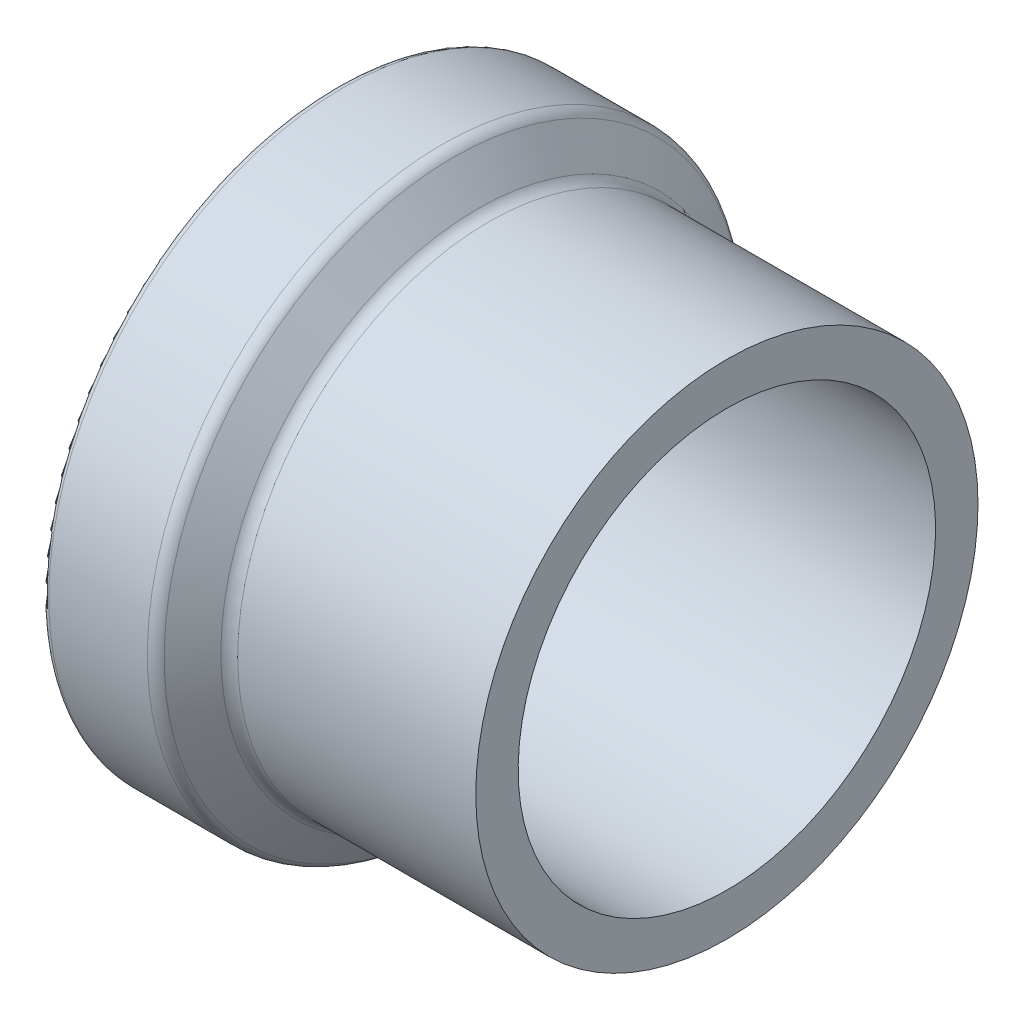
ISO-10303-21;
HEADER;
FILE_DESCRIPTION(('STEP AP214'),'2;1');
FILE_NAME('part.step','',(''),(''),'','','');
FILE_SCHEMA(('AUTOMOTIVE_DESIGN { 1 0 10303 214 1 1 1 1 }'));
ENDSEC;
DATA;
#1=APPLICATION_CONTEXT('core data for automotive mechanical design processes');
#2=APPLICATION_PROTOCOL_DEFINITION('international standard','automotive_design',2000,#1);
#3=PRODUCT_CONTEXT('',#1,'mechanical');
#4=PRODUCT('Part','Part','',(#3));
#5=PRODUCT_RELATED_PRODUCT_CATEGORY('part','',(#4));
#6=PRODUCT_DEFINITION_FORMATION('','',#4);
#7=PRODUCT_DEFINITION_CONTEXT('part definition',#1,'design');
#8=PRODUCT_DEFINITION('design','',#6,#7);
#9=PRODUCT_DEFINITION_SHAPE('','',#8);
#10=(LENGTH_UNIT() NAMED_UNIT(*) SI_UNIT(.MILLI.,.METRE.));
#11=(NAMED_UNIT(*) PLANE_ANGLE_UNIT() SI_UNIT($,.RADIAN.));
#12=(NAMED_UNIT(*) SI_UNIT($,.STERADIAN.) SOLID_ANGLE_UNIT());
#13=UNCERTAINTY_MEASURE_WITH_UNIT(LENGTH_MEASURE(1.E-05),#10,'distance_accuracy_value','');
#14=(GEOMETRIC_REPRESENTATION_CONTEXT(3) GLOBAL_UNCERTAINTY_ASSIGNED_CONTEXT((#13)) GLOBAL_UNIT_ASSIGNED_CONTEXT((#10,
#11,#12)) REPRESENTATION_CONTEXT('',''));
#15=CARTESIAN_POINT('',(0.,0.,0.));
#16=DIRECTION('',(0.,0.,1.));
#17=DIRECTION('',(1.,0.,0.));
#18=AXIS2_PLACEMENT_3D('',#15,#16,#17);
#19=CARTESIAN_POINT('',(8.6604164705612,28.575,0.));
#20=DIRECTION('',(1.,0.,0.));
#21=DIRECTION('',(0.,1.,0.));
#22=AXIS2_PLACEMENT_3D('',#19,#20,#21);
#23=PLANE('',#22);
#24=CARTESIAN_POINT('',(8.6604164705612,0.,0.));
#25=DIRECTION('',(1.,0.,0.));
#26=DIRECTION('',(0.,1.,0.));
#27=AXIS2_PLACEMENT_3D('',#24,#25,#26);
#28=CIRCLE('',#27,28.575);
#29=CARTESIAN_POINT('',(8.66041647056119,28.575,0.));
#30=VERTEX_POINT('',#29);
#31=EDGE_CURVE('E74',#30,#30,#28,.T.);
#32=ORIENTED_EDGE('',*,*,#31,.T.);
#33=EDGE_LOOP('',(#32));
#34=FACE_BOUND('',#33,.T.);
#35=CARTESIAN_POINT('',(8.6604164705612,0.,0.));
#36=DIRECTION('',(1.,0.,0.));
#37=DIRECTION('',(0.,1.,0.));
#38=AXIS2_PLACEMENT_3D('',#35,#36,#37);
#39=CIRCLE('',#38,23.749);
#40=CARTESIAN_POINT('',(8.6604164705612,23.749,0.));
#41=VERTEX_POINT('',#40);
#42=EDGE_CURVE('E10',#41,#41,#39,.T.);
#43=ORIENTED_EDGE('',*,*,#42,.F.);
#44=EDGE_LOOP('',(#43));
#45=FACE_BOUND('',#44,.T.);
#46=ADVANCED_FACE('F31',(#34,#45),#23,.T.);
#47=CARTESIAN_POINT('',(0.,0.,0.));
#48=DIRECTION('',(1.,0.,0.));
#49=DIRECTION('',(0.,1.,0.));
#50=AXIS2_PLACEMENT_3D('',#47,#48,#49);
#51=CYLINDRICAL_SURFACE('',#50,23.749);
#52=ORIENTED_EDGE('',*,*,#42,.T.);
#53=EDGE_LOOP('',(#52));
#54=FACE_BOUND('',#53,.T.);
#55=CARTESIAN_POINT('',(-27.9917835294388,0.,0.));
#56=DIRECTION('',(1.,0.,0.));
#57=DIRECTION('',(0.,1.,0.));
#58=AXIS2_PLACEMENT_3D('',#55,#56,#57);
#59=CIRCLE('',#58,23.749);
#60=CARTESIAN_POINT('',(-27.9917835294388,23.749,0.));
#61=VERTEX_POINT('',#60);
#62=EDGE_CURVE('E37',#61,#61,#59,.T.);
#63=ORIENTED_EDGE('',*,*,#62,.F.);
#64=EDGE_LOOP('',(#63));
#65=FACE_BOUND('',#64,.T.);
#66=ADVANCED_FACE('F92',(#54,#65),#51,.F.);
#67=CARTESIAN_POINT('',(-27.9917835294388,23.749,0.));
#68=DIRECTION('',(-1.,0.,0.));
#69=DIRECTION('',(0.,-1.,0.));
#70=AXIS2_PLACEMENT_3D('',#67,#68,#69);
#71=PLANE('',#70);
#72=ORIENTED_EDGE('',*,*,#62,.T.);
#73=EDGE_LOOP('',(#72));
#74=FACE_BOUND('',#73,.T.);
#75=CARTESIAN_POINT('',(-27.9917835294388,0.,0.));
#76=DIRECTION('',(1.,0.,0.));
#77=DIRECTION('',(0.,1.,0.));
#78=AXIS2_PLACEMENT_3D('',#75,#76,#77);
#79=CIRCLE('',#78,27.8003);
#80=CARTESIAN_POINT('',(-27.9917835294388,27.8003,0.));
#81=VERTEX_POINT('',#80);
#82=EDGE_CURVE('E41',#81,#81,#79,.T.);
#83=ORIENTED_EDGE('',*,*,#82,.F.);
#84=EDGE_LOOP('',(#83));
#85=FACE_BOUND('',#84,.T.);
#86=ADVANCED_FACE('F96',(#74,#85),#71,.T.);
#87=CARTESIAN_POINT('',(-28.8045835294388,0.,0.));
#88=DIRECTION('',(1.,0.,0.));
#89=DIRECTION('',(0.,1.,0.));
#90=AXIS2_PLACEMENT_3D('',#87,#88,#89);
#91=TOROIDAL_SURFACE('',#90,27.8003,0.812799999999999);
#92=ORIENTED_EDGE('',*,*,#82,.T.);
#93=EDGE_LOOP('',(#92));
#94=FACE_BOUND('',#93,.T.);
#95=CARTESIAN_POINT('',(-28.8045835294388,0.,0.));
#96=DIRECTION('',(1.,0.,0.));
#97=DIRECTION('',(0.,1.,0.));
#98=AXIS2_PLACEMENT_3D('',#95,#96,#97);
#99=CIRCLE('',#98,28.6131);
#100=CARTESIAN_POINT('',(-28.8045835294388,28.6131,0.));
#101=VERTEX_POINT('',#100);
#102=EDGE_CURVE('E45',#101,#101,#99,.T.);
#103=ORIENTED_EDGE('',*,*,#102,.F.);
#104=EDGE_LOOP('',(#103));
#105=FACE_BOUND('',#104,.T.);
#106=ADVANCED_FACE('F100',(#94,#105),#91,.F.);
#107=CARTESIAN_POINT('',(0.,0.,0.));
#108=DIRECTION('',(1.,0.,0.));
#109=DIRECTION('',(0.,1.,0.));
#110=AXIS2_PLACEMENT_3D('',#107,#108,#109);
#111=CYLINDRICAL_SURFACE('',#110,28.6131);
#112=ORIENTED_EDGE('',*,*,#102,.T.);
#113=EDGE_LOOP('',(#112));
#114=FACE_BOUND('',#113,.T.);
#115=CARTESIAN_POINT('',(-34.9767835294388,0.,0.));
#116=DIRECTION('',(1.,0.,0.));
#117=DIRECTION('',(0.,1.,0.));
#118=AXIS2_PLACEMENT_3D('',#115,#116,#117);
#119=CIRCLE('',#118,28.6131);
#120=CARTESIAN_POINT('',(-34.9767835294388,28.6131,0.));
#121=VERTEX_POINT('',#120);
#122=EDGE_CURVE('E50',#121,#121,#119,.T.);
#123=ORIENTED_EDGE('',*,*,#122,.F.);
#124=EDGE_LOOP('',(#123));
#125=FACE_BOUND('',#124,.T.);
#126=ADVANCED_FACE('F106',(#114,#125),#111,.F.);
#127=CARTESIAN_POINT('',(-34.9767835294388,0.,0.));
#128=DIRECTION('',(1.,0.,0.));
#129=DIRECTION('',(0.,1.,0.));
#130=AXIS2_PLACEMENT_3D('',#127,#128,#129);
#131=TOROIDAL_SURFACE('',#130,29.4259,0.812800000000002);
#132=ORIENTED_EDGE('',*,*,#122,.T.);
#133=EDGE_LOOP('',(#132));
#134=FACE_BOUND('',#133,.T.);
#135=CARTESIAN_POINT('',(-35.7895835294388,0.,0.));
#136=DIRECTION('',(1.,0.,0.));
#137=DIRECTION('',(0.,1.,0.));
#138=AXIS2_PLACEMENT_3D('',#135,#136,#137);
#139=CIRCLE('',#138,29.4259);
#140=CARTESIAN_POINT('',(-35.7895835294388,29.4259,0.));
#141=VERTEX_POINT('',#140);
#142=EDGE_CURVE('E53',#141,#141,#139,.T.);
#143=ORIENTED_EDGE('',*,*,#142,.F.);
#144=EDGE_LOOP('',(#143));
#145=FACE_BOUND('',#144,.T.);
#146=ADVANCED_FACE('F110',(#134,#145),#131,.T.);
#147=CARTESIAN_POINT('',(-35.7895835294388,29.4259,0.));
#148=DIRECTION('',(-1.,0.,0.));
#149=DIRECTION('',(0.,-1.,0.));
#150=AXIS2_PLACEMENT_3D('',#147,#148,#149);
#151=PLANE('',#150);
#152=ORIENTED_EDGE('',*,*,#142,.T.);
#153=EDGE_LOOP('',(#152));
#154=FACE_BOUND('',#153,.T.);
#155=CARTESIAN_POINT('',(-35.7895835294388,0.,0.));
#156=DIRECTION('',(1.,0.,0.));
#157=DIRECTION('',(0.,1.,0.));
#158=AXIS2_PLACEMENT_3D('',#155,#156,#157);
#159=CIRCLE('',#158,32.7152);
#160=CARTESIAN_POINT('',(-35.7895835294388,32.7152,0.));
#161=VERTEX_POINT('',#160);
#162=EDGE_CURVE('E56',#161,#161,#159,.T.);
#163=ORIENTED_EDGE('',*,*,#162,.F.);
#164=EDGE_LOOP('',(#163));
#165=FACE_BOUND('',#164,.T.);
#166=ADVANCED_FACE('F114',(#154,#165),#151,.T.);
#167=CARTESIAN_POINT('',(-34.9767835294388,0.,0.));
#168=DIRECTION('',(1.,0.,0.));
#169=DIRECTION('',(0.,1.,0.));
#170=AXIS2_PLACEMENT_3D('',#167,#168,#169);
#171=TOROIDAL_SURFACE('',#170,32.7152,0.812800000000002);
#172=ORIENTED_EDGE('',*,*,#162,.T.);
#173=EDGE_LOOP('',(#172));
#174=FACE_BOUND('',#173,.T.);
#175=CARTESIAN_POINT('',(-34.9767835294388,0.,0.));
#176=DIRECTION('',(1.,0.,0.));
#177=DIRECTION('',(0.,1.,0.));
#178=AXIS2_PLACEMENT_3D('',#175,#176,#177);
#179=CIRCLE('',#178,33.528);
#180=CARTESIAN_POINT('',(-34.9767835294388,33.528,0.));
#181=VERTEX_POINT('',#180);
#182=EDGE_CURVE('E59',#181,#181,#179,.T.);
#183=ORIENTED_EDGE('',*,*,#182,.F.);
#184=EDGE_LOOP('',(#183));
#185=FACE_BOUND('',#184,.T.);
#186=ADVANCED_FACE('F118',(#174,#185),#171,.T.);
#187=CARTESIAN_POINT('',(0.,0.,0.));
#188=DIRECTION('',(1.,0.,0.));
#189=DIRECTION('',(0.,1.,0.));
#190=AXIS2_PLACEMENT_3D('',#187,#188,#189);
#191=CYLINDRICAL_SURFACE('',#190,33.528);
#192=ORIENTED_EDGE('',*,*,#182,.T.);
#193=EDGE_LOOP('',(#192));
#194=FACE_BOUND('',#193,.T.);
#195=CARTESIAN_POINT('',(-23.7604138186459,0.,0.));
#196=DIRECTION('',(1.,0.,0.));
#197=DIRECTION('',(0.,1.,0.));
#198=AXIS2_PLACEMENT_3D('',#195,#196,#197);
#199=CIRCLE('',#198,33.528);
#200=CARTESIAN_POINT('',(-23.7604138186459,33.528,0.));
#201=VERTEX_POINT('',#200);
#202=EDGE_CURVE('E62',#201,#201,#199,.T.);
#203=ORIENTED_EDGE('',*,*,#202,.F.);
#204=EDGE_LOOP('',(#203));
#205=FACE_BOUND('',#204,.T.);
#206=ADVANCED_FACE('F122',(#194,#205),#191,.T.);
#207=CARTESIAN_POINT('',(-23.7604138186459,0.,0.));
#208=DIRECTION('',(1.,0.,0.));
#209=DIRECTION('',(0.,1.,0.));
#210=AXIS2_PLACEMENT_3D('',#207,#208,#209);
#211=TOROIDAL_SURFACE('',#210,31.9278,1.6002);
#212=ORIENTED_EDGE('',*,*,#202,.T.);
#213=EDGE_LOOP('',(#212));
#214=FACE_BOUND('',#213,.T.);
#215=CARTESIAN_POINT('',(-22.4824372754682,0.,0.));
#216=DIRECTION('',(1.,0.,0.));
#217=DIRECTION('',(0.,1.,0.));
#218=AXIS2_PLACEMENT_3D('',#215,#216,#217);
#219=CIRCLE('',#218,32.8908244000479);
#220=CARTESIAN_POINT('',(-22.4824372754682,32.8908244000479,0.));
#221=VERTEX_POINT('',#220);
#222=EDGE_CURVE('E65',#221,#221,#219,.T.);
#223=ORIENTED_EDGE('',*,*,#222,.F.);
#224=EDGE_LOOP('',(#223));
#225=FACE_BOUND('',#224,.T.);
#226=ADVANCED_FACE('F126',(#214,#225),#211,.T.);
#227=CARTESIAN_POINT('',(-19.7103765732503,0.,0.));
#228=DIRECTION('',(-1.,0.,0.));
#229=DIRECTION('',(0.,-1.,0.));
#230=AXIS2_PLACEMENT_3D('',#227,#228,#229);
#231=CONICAL_SURFACE('',#230,29.2121755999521,0.925024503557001);
#232=ORIENTED_EDGE('',*,*,#222,.T.);
#233=EDGE_LOOP('',(#232));
#234=FACE_BOUND('',#233,.T.);
#235=CARTESIAN_POINT('',(-19.7103765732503,0.,0.));
#236=DIRECTION('',(1.,0.,0.));
#237=DIRECTION('',(0.,1.,0.));
#238=AXIS2_PLACEMENT_3D('',#235,#236,#237);
#239=CIRCLE('',#238,29.2121755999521);
#240=CARTESIAN_POINT('',(-19.7103765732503,29.2121755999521,0.));
#241=VERTEX_POINT('',#240);
#242=EDGE_CURVE('E68',#241,#241,#239,.T.);
#243=ORIENTED_EDGE('',*,*,#242,.F.);
#244=EDGE_LOOP('',(#243));
#245=FACE_BOUND('',#244,.T.);
#246=ADVANCED_FACE('F88',(#234,#245),#231,.T.);
#247=CARTESIAN_POINT('',(-18.4324000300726,0.,0.));
#248=DIRECTION('',(1.,0.,0.));
#249=DIRECTION('',(0.,1.,0.));
#250=AXIS2_PLACEMENT_3D('',#247,#248,#249);
#251=TOROIDAL_SURFACE('',#250,30.1752,1.6002);
#252=ORIENTED_EDGE('',*,*,#242,.T.);
#253=EDGE_LOOP('',(#252));
#254=FACE_BOUND('',#253,.T.);
#255=CARTESIAN_POINT('',(-18.4324000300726,0.,0.));
#256=DIRECTION('',(1.,0.,0.));
#257=DIRECTION('',(0.,1.,0.));
#258=AXIS2_PLACEMENT_3D('',#255,#256,#257);
#259=CIRCLE('',#258,28.575);
#260=CARTESIAN_POINT('',(-18.4324000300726,28.575,0.));
#261=VERTEX_POINT('',#260);
#262=EDGE_CURVE('E71',#261,#261,#259,.T.);
#263=ORIENTED_EDGE('',*,*,#262,.F.);
#264=EDGE_LOOP('',(#263));
#265=FACE_BOUND('',#264,.T.);
#266=ADVANCED_FACE('F82',(#254,#265),#251,.F.);
#267=CARTESIAN_POINT('',(0.,0.,0.));
#268=DIRECTION('',(1.,0.,0.));
#269=DIRECTION('',(0.,1.,0.));
#270=AXIS2_PLACEMENT_3D('',#267,#268,#269);
#271=CYLINDRICAL_SURFACE('',#270,28.575);
#272=ORIENTED_EDGE('',*,*,#262,.T.);
#273=EDGE_LOOP('',(#272));
#274=FACE_BOUND('',#273,.T.);
#275=ORIENTED_EDGE('',*,*,#31,.F.);
#276=EDGE_LOOP('',(#275));
#277=FACE_BOUND('',#276,.T.);
#278=ADVANCED_FACE('F80',(#274,#277),#271,.T.);
#279=CLOSED_SHELL('',(#46,#66,#86,#106,#126,#146,#166,#186,#206,#226,#246,#266,#278));
#280=MANIFOLD_SOLID_BREP('B2',#279);
#281=ADVANCED_BREP_SHAPE_REPRESENTATION('',(#18,#280),#14);
#282=SHAPE_DEFINITION_REPRESENTATION(#9,#281);
ENDSEC;
END-ISO-10303-21;
